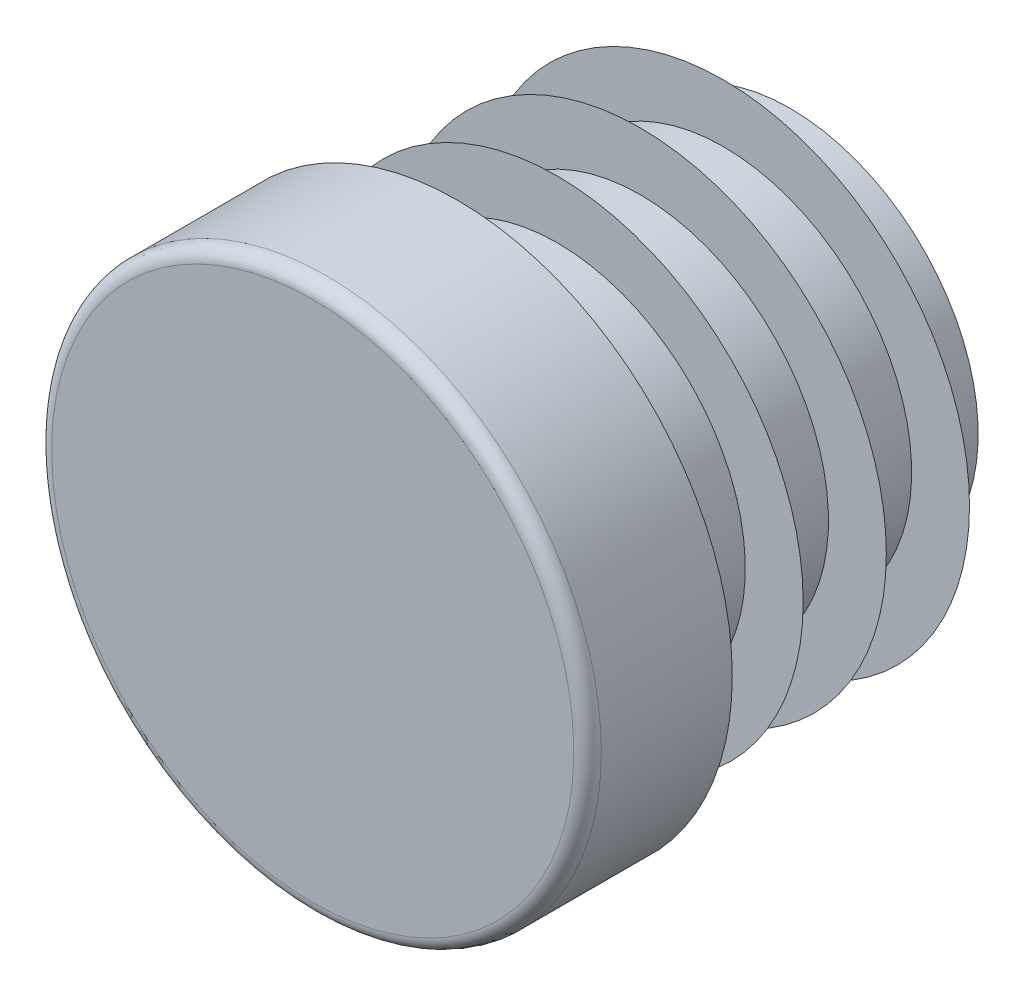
ISO-10303-21;
HEADER;
FILE_DESCRIPTION(('STEP AP214'),'2;1');
FILE_NAME('part.step','',(''),(''),'','','');
FILE_SCHEMA(('AUTOMOTIVE_DESIGN { 1 0 10303 214 1 1 1 1 }'));
ENDSEC;
DATA;
#1=APPLICATION_CONTEXT('core data for automotive mechanical design processes');
#2=APPLICATION_PROTOCOL_DEFINITION('international standard','automotive_design',2000,#1);
#3=PRODUCT_CONTEXT('',#1,'mechanical');
#4=PRODUCT('Part','Part','',(#3));
#5=PRODUCT_RELATED_PRODUCT_CATEGORY('part','',(#4));
#6=PRODUCT_DEFINITION_FORMATION('','',#4);
#7=PRODUCT_DEFINITION_CONTEXT('part definition',#1,'design');
#8=PRODUCT_DEFINITION('design','',#6,#7);
#9=PRODUCT_DEFINITION_SHAPE('','',#8);
#10=(LENGTH_UNIT() NAMED_UNIT(*) SI_UNIT(.MILLI.,.METRE.));
#11=(NAMED_UNIT(*) PLANE_ANGLE_UNIT() SI_UNIT($,.RADIAN.));
#12=(NAMED_UNIT(*) SI_UNIT($,.STERADIAN.) SOLID_ANGLE_UNIT());
#13=UNCERTAINTY_MEASURE_WITH_UNIT(LENGTH_MEASURE(1.E-05),#10,'distance_accuracy_value','');
#14=(GEOMETRIC_REPRESENTATION_CONTEXT(3) GLOBAL_UNCERTAINTY_ASSIGNED_CONTEXT((#13)) GLOBAL_UNIT_ASSIGNED_CONTEXT((#10,
#11,#12)) REPRESENTATION_CONTEXT('',''));
#15=CARTESIAN_POINT('',(0.,0.,0.));
#16=DIRECTION('',(0.,0.,1.));
#17=DIRECTION('',(1.,0.,0.));
#18=AXIS2_PLACEMENT_3D('',#15,#16,#17);
#19=CARTESIAN_POINT('',(0.,0.,5.));
#20=DIRECTION('',(0.,0.,-1.));
#21=DIRECTION('',(0.,1.,0.));
#22=AXIS2_PLACEMENT_3D('',#19,#20,#21);
#23=PLANE('',#22);
#24=CARTESIAN_POINT('',(0.,0.,5.));
#25=DIRECTION('',(0.,0.,-1.));
#26=DIRECTION('',(0.,1.,0.));
#27=AXIS2_PLACEMENT_3D('',#24,#25,#26);
#28=CIRCLE('',#27,9.025);
#29=CARTESIAN_POINT('',(0.,9.025,5.));
#30=VERTEX_POINT('',#29);
#31=EDGE_CURVE('E8',#30,#30,#28,.T.);
#32=ORIENTED_EDGE('',*,*,#31,.F.);
#33=EDGE_LOOP('',(#32));
#34=FACE_BOUND('',#33,.T.);
#35=ADVANCED_FACE('F12',(#34),#23,.F.);
#36=CARTESIAN_POINT('',(0.,0.,4.525));
#37=DIRECTION('',(0.,0.,-1.));
#38=DIRECTION('',(0.,1.,0.));
#39=AXIS2_PLACEMENT_3D('',#36,#37,#38);
#40=TOROIDAL_SURFACE('',#39,9.025,0.475);
#41=ORIENTED_EDGE('',*,*,#31,.T.);
#42=EDGE_LOOP('',(#41));
#43=FACE_BOUND('',#42,.T.);
#44=CARTESIAN_POINT('',(0.,0.,4.52500000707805));
#45=DIRECTION('',(0.,0.,-1.));
#46=DIRECTION('',(0.,1.,0.));
#47=AXIS2_PLACEMENT_3D('',#44,#45,#46);
#48=CIRCLE('',#47,9.5);
#49=CARTESIAN_POINT('',(0.,9.5,4.52500000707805));
#50=VERTEX_POINT('',#49);
#51=EDGE_CURVE('E18',#50,#50,#48,.T.);
#52=ORIENTED_EDGE('',*,*,#51,.F.);
#53=EDGE_LOOP('',(#52));
#54=FACE_BOUND('',#53,.T.);
#55=ADVANCED_FACE('F159',(#43,#54),#40,.T.);
#56=CARTESIAN_POINT('',(0.,0.,-11.5));
#57=DIRECTION('',(0.,0.,-1.));
#58=DIRECTION('',(0.,1.,0.));
#59=AXIS2_PLACEMENT_3D('',#56,#57,#58);
#60=CYLINDRICAL_SURFACE('',#59,9.5);
#61=CARTESIAN_POINT('',(0.,0.,0.));
#62=DIRECTION('',(0.,0.,-1.));
#63=DIRECTION('',(0.,1.,0.));
#64=AXIS2_PLACEMENT_3D('',#61,#62,#63);
#65=CIRCLE('',#64,9.5);
#66=CARTESIAN_POINT('',(0.,9.5,0.));
#67=VERTEX_POINT('',#66);
#68=EDGE_CURVE('E22',#67,#67,#65,.T.);
#69=ORIENTED_EDGE('',*,*,#68,.F.);
#70=EDGE_LOOP('',(#69));
#71=FACE_BOUND('',#70,.T.);
#72=ORIENTED_EDGE('',*,*,#51,.T.);
#73=EDGE_LOOP('',(#72));
#74=FACE_BOUND('',#73,.T.);
#75=ADVANCED_FACE('F154',(#71,#74),#60,.T.);
#76=CARTESIAN_POINT('',(9.5,0.,0.));
#77=DIRECTION('',(0.,0.,1.));
#78=DIRECTION('',(0.,-1.,0.));
#79=AXIS2_PLACEMENT_3D('',#76,#77,#78);
#80=PLANE('',#79);
#81=CARTESIAN_POINT('',(0.,0.,0.));
#82=DIRECTION('',(0.,0.,-1.));
#83=DIRECTION('',(0.,1.,0.));
#84=AXIS2_PLACEMENT_3D('',#81,#82,#83);
#85=CIRCLE('',#84,6.5);
#86=CARTESIAN_POINT('',(0.,6.5,0.));
#87=VERTEX_POINT('',#86);
#88=EDGE_CURVE('E26',#87,#87,#85,.T.);
#89=ORIENTED_EDGE('',*,*,#88,.F.);
#90=EDGE_LOOP('',(#89));
#91=FACE_BOUND('',#90,.T.);
#92=ORIENTED_EDGE('',*,*,#68,.T.);
#93=EDGE_LOOP('',(#92));
#94=FACE_BOUND('',#93,.T.);
#95=ADVANCED_FACE('F148',(#91,#94),#80,.F.);
#96=CARTESIAN_POINT('',(0.,0.,-11.5));
#97=DIRECTION('',(0.,0.,-1.));
#98=DIRECTION('',(0.,1.,0.));
#99=AXIS2_PLACEMENT_3D('',#96,#97,#98);
#100=CYLINDRICAL_SURFACE('',#99,6.5);
#101=CARTESIAN_POINT('',(0.,0.,-0.575));
#102=DIRECTION('',(0.,0.,-1.));
#103=DIRECTION('',(0.,1.,0.));
#104=AXIS2_PLACEMENT_3D('',#101,#102,#103);
#105=CIRCLE('',#104,6.5);
#106=CARTESIAN_POINT('',(0.,6.5,-0.575));
#107=VERTEX_POINT('',#106);
#108=EDGE_CURVE('E31',#107,#107,#105,.T.);
#109=ORIENTED_EDGE('',*,*,#108,.F.);
#110=EDGE_LOOP('',(#109));
#111=FACE_BOUND('',#110,.T.);
#112=ORIENTED_EDGE('',*,*,#88,.T.);
#113=EDGE_LOOP('',(#112));
#114=FACE_BOUND('',#113,.T.);
#115=ADVANCED_FACE('F142',(#111,#114),#100,.T.);
#116=CARTESIAN_POINT('',(6.5,0.,-0.575));
#117=DIRECTION('',(0.,0.,-1.));
#118=DIRECTION('',(0.,1.,0.));
#119=AXIS2_PLACEMENT_3D('',#116,#117,#118);
#120=PLANE('',#119);
#121=CARTESIAN_POINT('',(0.,0.,-0.575));
#122=DIRECTION('',(0.,0.,-1.));
#123=DIRECTION('',(0.,1.,0.));
#124=AXIS2_PLACEMENT_3D('',#121,#122,#123);
#125=CIRCLE('',#124,8.5);
#126=CARTESIAN_POINT('',(0.,8.5,-0.575));
#127=VERTEX_POINT('',#126);
#128=EDGE_CURVE('E34',#127,#127,#125,.T.);
#129=ORIENTED_EDGE('',*,*,#128,.F.);
#130=EDGE_LOOP('',(#129));
#131=FACE_BOUND('',#130,.T.);
#132=ORIENTED_EDGE('',*,*,#108,.T.);
#133=EDGE_LOOP('',(#132));
#134=FACE_BOUND('',#133,.T.);
#135=ADVANCED_FACE('F136',(#131,#134),#120,.F.);
#136=CARTESIAN_POINT('',(0.,0.,-0.575));
#137=DIRECTION('',(0.,0.,1.));
#138=DIRECTION('',(0.,-1.,0.));
#139=AXIS2_PLACEMENT_3D('',#136,#137,#138);
#140=CONICAL_SURFACE('',#139,8.5,0.959931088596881);
#141=CARTESIAN_POINT('',(0.,0.,-1.97541507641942));
#142=DIRECTION('',(0.,0.,-1.));
#143=DIRECTION('',(0.,1.,0.));
#144=AXIS2_PLACEMENT_3D('',#141,#142,#143);
#145=CIRCLE('',#144,6.5);
#146=CARTESIAN_POINT('',(0.,6.5,-1.97541507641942));
#147=VERTEX_POINT('',#146);
#148=EDGE_CURVE('E37',#147,#147,#145,.T.);
#149=ORIENTED_EDGE('',*,*,#148,.F.);
#150=EDGE_LOOP('',(#149));
#151=FACE_BOUND('',#150,.T.);
#152=ORIENTED_EDGE('',*,*,#128,.T.);
#153=EDGE_LOOP('',(#152));
#154=FACE_BOUND('',#153,.T.);
#155=ADVANCED_FACE('F130',(#151,#154),#140,.T.);
#156=CARTESIAN_POINT('',(0.,0.,-11.5));
#157=DIRECTION('',(0.,0.,-1.));
#158=DIRECTION('',(0.,1.,0.));
#159=AXIS2_PLACEMENT_3D('',#156,#157,#158);
#160=CYLINDRICAL_SURFACE('',#159,6.5);
#161=CARTESIAN_POINT('',(0.,0.,-3.45));
#162=DIRECTION('',(0.,0.,-1.));
#163=DIRECTION('',(0.,1.,0.));
#164=AXIS2_PLACEMENT_3D('',#161,#162,#163);
#165=CIRCLE('',#164,6.5);
#166=CARTESIAN_POINT('',(0.,6.5,-3.45));
#167=VERTEX_POINT('',#166);
#168=EDGE_CURVE('E40',#167,#167,#165,.T.);
#169=ORIENTED_EDGE('',*,*,#168,.F.);
#170=EDGE_LOOP('',(#169));
#171=FACE_BOUND('',#170,.T.);
#172=ORIENTED_EDGE('',*,*,#148,.T.);
#173=EDGE_LOOP('',(#172));
#174=FACE_BOUND('',#173,.T.);
#175=ADVANCED_FACE('F124',(#171,#174),#160,.T.);
#176=CARTESIAN_POINT('',(6.5,0.,-3.45));
#177=DIRECTION('',(0.,0.,-1.));
#178=DIRECTION('',(0.,1.,0.));
#179=AXIS2_PLACEMENT_3D('',#176,#177,#178);
#180=PLANE('',#179);
#181=CARTESIAN_POINT('',(0.,0.,-3.45));
#182=DIRECTION('',(0.,0.,-1.));
#183=DIRECTION('',(0.,1.,0.));
#184=AXIS2_PLACEMENT_3D('',#181,#182,#183);
#185=CIRCLE('',#184,8.5);
#186=CARTESIAN_POINT('',(0.,8.5,-3.45));
#187=VERTEX_POINT('',#186);
#188=EDGE_CURVE('E43',#187,#187,#185,.T.);
#189=ORIENTED_EDGE('',*,*,#188,.F.);
#190=EDGE_LOOP('',(#189));
#191=FACE_BOUND('',#190,.T.);
#192=ORIENTED_EDGE('',*,*,#168,.T.);
#193=EDGE_LOOP('',(#192));
#194=FACE_BOUND('',#193,.T.);
#195=ADVANCED_FACE('F118',(#191,#194),#180,.F.);
#196=CARTESIAN_POINT('',(0.,0.,-3.45));
#197=DIRECTION('',(0.,0.,1.));
#198=DIRECTION('',(0.,-1.,0.));
#199=AXIS2_PLACEMENT_3D('',#196,#197,#198);
#200=CONICAL_SURFACE('',#199,8.5,0.959931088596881);
#201=CARTESIAN_POINT('',(0.,0.,-4.85041507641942));
#202=DIRECTION('',(0.,0.,-1.));
#203=DIRECTION('',(0.,1.,0.));
#204=AXIS2_PLACEMENT_3D('',#201,#202,#203);
#205=CIRCLE('',#204,6.5);
#206=CARTESIAN_POINT('',(0.,6.5,-4.85041507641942));
#207=VERTEX_POINT('',#206);
#208=EDGE_CURVE('E46',#207,#207,#205,.T.);
#209=ORIENTED_EDGE('',*,*,#208,.F.);
#210=EDGE_LOOP('',(#209));
#211=FACE_BOUND('',#210,.T.);
#212=ORIENTED_EDGE('',*,*,#188,.T.);
#213=EDGE_LOOP('',(#212));
#214=FACE_BOUND('',#213,.T.);
#215=ADVANCED_FACE('F112',(#211,#214),#200,.T.);
#216=CARTESIAN_POINT('',(0.,0.,-11.5));
#217=DIRECTION('',(0.,0.,-1.));
#218=DIRECTION('',(0.,1.,0.));
#219=AXIS2_PLACEMENT_3D('',#216,#217,#218);
#220=CYLINDRICAL_SURFACE('',#219,6.5);
#221=CARTESIAN_POINT('',(0.,0.,-6.325));
#222=DIRECTION('',(0.,0.,-1.));
#223=DIRECTION('',(0.,1.,0.));
#224=AXIS2_PLACEMENT_3D('',#221,#222,#223);
#225=CIRCLE('',#224,6.5);
#226=CARTESIAN_POINT('',(0.,6.5,-6.325));
#227=VERTEX_POINT('',#226);
#228=EDGE_CURVE('E49',#227,#227,#225,.T.);
#229=ORIENTED_EDGE('',*,*,#228,.F.);
#230=EDGE_LOOP('',(#229));
#231=FACE_BOUND('',#230,.T.);
#232=ORIENTED_EDGE('',*,*,#208,.T.);
#233=EDGE_LOOP('',(#232));
#234=FACE_BOUND('',#233,.T.);
#235=ADVANCED_FACE('F106',(#231,#234),#220,.T.);
#236=CARTESIAN_POINT('',(6.5,0.,-6.325));
#237=DIRECTION('',(0.,0.,-1.));
#238=DIRECTION('',(0.,1.,0.));
#239=AXIS2_PLACEMENT_3D('',#236,#237,#238);
#240=PLANE('',#239);
#241=CARTESIAN_POINT('',(0.,0.,-6.325));
#242=DIRECTION('',(0.,0.,-1.));
#243=DIRECTION('',(0.,1.,0.));
#244=AXIS2_PLACEMENT_3D('',#241,#242,#243);
#245=CIRCLE('',#244,8.5);
#246=CARTESIAN_POINT('',(0.,8.5,-6.325));
#247=VERTEX_POINT('',#246);
#248=EDGE_CURVE('E52',#247,#247,#245,.T.);
#249=ORIENTED_EDGE('',*,*,#248,.F.);
#250=EDGE_LOOP('',(#249));
#251=FACE_BOUND('',#250,.T.);
#252=ORIENTED_EDGE('',*,*,#228,.T.);
#253=EDGE_LOOP('',(#252));
#254=FACE_BOUND('',#253,.T.);
#255=ADVANCED_FACE('F100',(#251,#254),#240,.F.);
#256=CARTESIAN_POINT('',(0.,0.,-6.325));
#257=DIRECTION('',(0.,0.,1.));
#258=DIRECTION('',(0.,-1.,0.));
#259=AXIS2_PLACEMENT_3D('',#256,#257,#258);
#260=CONICAL_SURFACE('',#259,8.5,0.959931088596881);
#261=CARTESIAN_POINT('',(0.,0.,-7.72541507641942));
#262=DIRECTION('',(0.,0.,-1.));
#263=DIRECTION('',(0.,1.,0.));
#264=AXIS2_PLACEMENT_3D('',#261,#262,#263);
#265=CIRCLE('',#264,6.5);
#266=CARTESIAN_POINT('',(0.,6.5,-7.72541507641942));
#267=VERTEX_POINT('',#266);
#268=EDGE_CURVE('E55',#267,#267,#265,.T.);
#269=ORIENTED_EDGE('',*,*,#268,.F.);
#270=EDGE_LOOP('',(#269));
#271=FACE_BOUND('',#270,.T.);
#272=ORIENTED_EDGE('',*,*,#248,.T.);
#273=EDGE_LOOP('',(#272));
#274=FACE_BOUND('',#273,.T.);
#275=ADVANCED_FACE('F94',(#271,#274),#260,.T.);
#276=CARTESIAN_POINT('',(0.,0.,-11.5));
#277=DIRECTION('',(0.,0.,-1.));
#278=DIRECTION('',(0.,1.,0.));
#279=AXIS2_PLACEMENT_3D('',#276,#277,#278);
#280=CYLINDRICAL_SURFACE('',#279,6.5);
#281=CARTESIAN_POINT('',(0.,0.,-9.2));
#282=DIRECTION('',(0.,0.,-1.));
#283=DIRECTION('',(0.,1.,0.));
#284=AXIS2_PLACEMENT_3D('',#281,#282,#283);
#285=CIRCLE('',#284,6.5);
#286=CARTESIAN_POINT('',(0.,6.5,-9.2));
#287=VERTEX_POINT('',#286);
#288=EDGE_CURVE('E58',#287,#287,#285,.T.);
#289=ORIENTED_EDGE('',*,*,#288,.F.);
#290=EDGE_LOOP('',(#289));
#291=FACE_BOUND('',#290,.T.);
#292=ORIENTED_EDGE('',*,*,#268,.T.);
#293=EDGE_LOOP('',(#292));
#294=FACE_BOUND('',#293,.T.);
#295=ADVANCED_FACE('F88',(#291,#294),#280,.T.);
#296=CARTESIAN_POINT('',(6.5,0.,-9.2));
#297=DIRECTION('',(0.,0.,-1.));
#298=DIRECTION('',(0.,1.,0.));
#299=AXIS2_PLACEMENT_3D('',#296,#297,#298);
#300=PLANE('',#299);
#301=CARTESIAN_POINT('',(0.,0.,-9.2));
#302=DIRECTION('',(0.,0.,-1.));
#303=DIRECTION('',(0.,1.,0.));
#304=AXIS2_PLACEMENT_3D('',#301,#302,#303);
#305=CIRCLE('',#304,8.5);
#306=CARTESIAN_POINT('',(0.,8.5,-9.2));
#307=VERTEX_POINT('',#306);
#308=EDGE_CURVE('E61',#307,#307,#305,.T.);
#309=ORIENTED_EDGE('',*,*,#308,.F.);
#310=EDGE_LOOP('',(#309));
#311=FACE_BOUND('',#310,.T.);
#312=ORIENTED_EDGE('',*,*,#288,.T.);
#313=EDGE_LOOP('',(#312));
#314=FACE_BOUND('',#313,.T.);
#315=ADVANCED_FACE('F82',(#311,#314),#300,.F.);
#316=CARTESIAN_POINT('',(0.,0.,-9.2));
#317=DIRECTION('',(0.,0.,1.));
#318=DIRECTION('',(0.,-1.,0.));
#319=AXIS2_PLACEMENT_3D('',#316,#317,#318);
#320=CONICAL_SURFACE('',#319,8.5,0.959931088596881);
#321=CARTESIAN_POINT('',(0.,0.,-10.6004150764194));
#322=DIRECTION('',(0.,0.,-1.));
#323=DIRECTION('',(0.,1.,0.));
#324=AXIS2_PLACEMENT_3D('',#321,#322,#323);
#325=CIRCLE('',#324,6.5);
#326=CARTESIAN_POINT('',(0.,6.5,-10.6004150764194));
#327=VERTEX_POINT('',#326);
#328=EDGE_CURVE('E64',#327,#327,#325,.T.);
#329=ORIENTED_EDGE('',*,*,#328,.F.);
#330=EDGE_LOOP('',(#329));
#331=FACE_BOUND('',#330,.T.);
#332=ORIENTED_EDGE('',*,*,#308,.T.);
#333=EDGE_LOOP('',(#332));
#334=FACE_BOUND('',#333,.T.);
#335=ADVANCED_FACE('F76',(#331,#334),#320,.T.);
#336=CARTESIAN_POINT('',(0.,0.,-11.5));
#337=DIRECTION('',(0.,0.,-1.));
#338=DIRECTION('',(0.,1.,0.));
#339=AXIS2_PLACEMENT_3D('',#336,#337,#338);
#340=CYLINDRICAL_SURFACE('',#339,6.5);
#341=CARTESIAN_POINT('',(0.,0.,-11.5));
#342=DIRECTION('',(0.,0.,-1.));
#343=DIRECTION('',(0.,1.,0.));
#344=AXIS2_PLACEMENT_3D('',#341,#342,#343);
#345=CIRCLE('',#344,6.5);
#346=CARTESIAN_POINT('',(0.,6.5,-11.5));
#347=VERTEX_POINT('',#346);
#348=EDGE_CURVE('E67',#347,#347,#345,.T.);
#349=ORIENTED_EDGE('',*,*,#348,.F.);
#350=EDGE_LOOP('',(#349));
#351=FACE_BOUND('',#350,.T.);
#352=ORIENTED_EDGE('',*,*,#328,.T.);
#353=EDGE_LOOP('',(#352));
#354=FACE_BOUND('',#353,.T.);
#355=ADVANCED_FACE('F73',(#351,#354),#340,.T.);
#356=CARTESIAN_POINT('',(6.5,0.,-11.5));
#357=DIRECTION('',(0.,0.,1.));
#358=DIRECTION('',(0.,-1.,0.));
#359=AXIS2_PLACEMENT_3D('',#356,#357,#358);
#360=PLANE('',#359);
#361=ORIENTED_EDGE('',*,*,#348,.T.);
#362=EDGE_LOOP('',(#361));
#363=FACE_BOUND('',#362,.T.);
#364=ADVANCED_FACE('F71',(#363),#360,.F.);
#365=CLOSED_SHELL('',(#35,#55,#75,#95,#115,#135,#155,#175,#195,#215,#235,#255,#275,#295,#315,
#335,#355,#364));
#366=MANIFOLD_SOLID_BREP('B1',#365);
#367=ADVANCED_BREP_SHAPE_REPRESENTATION('',(#18,#366),#14);
#368=SHAPE_DEFINITION_REPRESENTATION(#9,#367);
ENDSEC;
END-ISO-10303-21;
